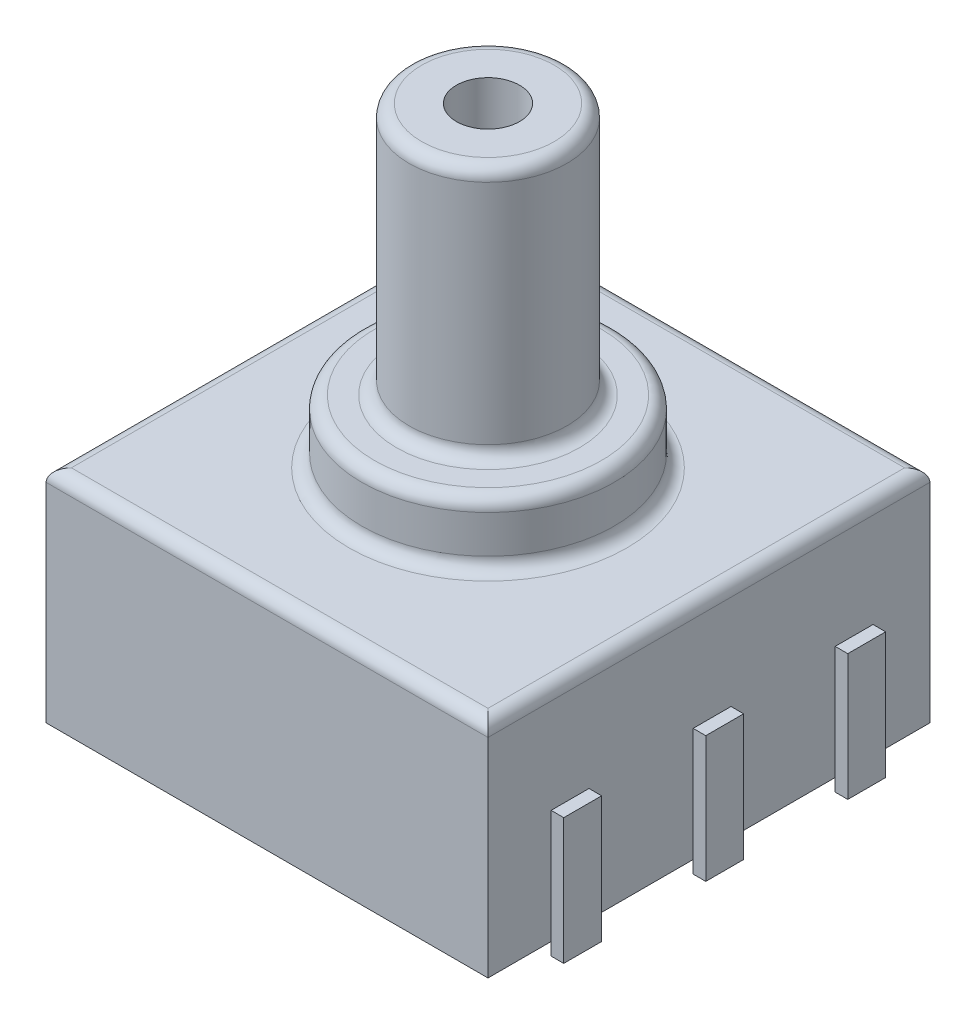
from build123d import *

# Parameters (mm, degrees)
ESQUISSE1_W                          = 7
ESQUISSE1_H                          = 7
EXTRUSION1_DEPTH                     = 3.5
CONG_1_R                             = 0.2
ESQUISSE3_W                          = 0.6
ESQUISSE3_H                          = 2
EXTRUSION2_DEPTH                     = 0.2
R_P_TITION_LIN_AIRE1_COUNT           = 3
R_P_TITION_LIN_AIRE1_PITCH           = 2.25
R_P_TITION_LIN_AIRE1_COPY_1_SKETCH_W = 0.6
R_P_TITION_LIN_AIRE1_COPY_1_SKETCH_H = 2
R_P_TITION_LIN_AIRE1_COPY_1_DEPTH    = 0.2
R_P_TITION_LIN_AIRE1_COPY_2_SKETCH_W = 0.6
R_P_TITION_LIN_AIRE1_COPY_2_SKETCH_H = 2
R_P_TITION_LIN_AIRE1_COPY_2_DEPTH    = 0.2


with BuildPart() as part:
    # Esquisse1 → Extrusion1 (new body)
    with BuildSketch(Plane(origin=(0, 0, 0), x_dir=(1, 0, 0), z_dir=(0, 1, 0))):
        Rectangle(ESQUISSE1_W, ESQUISSE1_H)
    extrude(amount=EXTRUSION1_DEPTH)

    # Esquisse2 → R_volution1 (revolve)
    with BuildSketch(Plane(origin=(0, 0, 0), x_dir=(0, 0, -1), z_dir=(1, 0, 0))):
        with BuildLine():
            Line((-2, 3.5), (-2, 4.5))
            Line((-2, 4.5), (-1.25, 4.5))
            Line((-1.25, 4.5), (-1.25, 8.3))
            ThreePointArc((-1.25, 8.3), (-1.191421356, 8.441421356), (-1.05, 8.5))
            Line((-1.05, 8.5), (-0.5, 8.5))
            Line((-0.5, 8.5), (-0.5, 3.5))
            Line((-0.5, 3.5), (-2, 3.5))
        make_face()
    revolve(axis=Axis((0, 7.028883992, 0), (0, -1, 0)))

    # Cong_1
    cong_1_edges = [part.edges().sort_by_distance(p)[0] for p in [
        (3.5, 3.5, 0),
        (0, 3.5, -3.5),
        (0, 3.5, -2),
        (0, 4.5, -2),
        (0, 4.5, -1.25),
        (-3.5, 3.5, 0),
        (0, 3.5, 3.5),
    ]]
    fillet(cong_1_edges, radius=CONG_1_R)

    # Esquisse3 → Extrusion2 (add)
    with BuildSketch(Plane(origin=(3.5, 0, 0), x_dir=(0, 0, -1), z_dir=(1, 0, 0))):
        with Locations((-2.2, 0.8)):
            Rectangle(ESQUISSE3_W, ESQUISSE3_H)
    extrusion2 = extrude(amount=EXTRUSION2_DEPTH)

    # Sym_trie1: Extrusion2 across plane
    add(extrusion2.mirror(Plane(origin=(0, 0, 0), x_dir=(0, 0, 1), z_dir=(1, 0, 0))))

    # R_p_tition lin_aire1: Extrusion2 ×3
    with Locations(*[(0, 0, -i * R_P_TITION_LIN_AIRE1_PITCH) for i in range(1, R_P_TITION_LIN_AIRE1_COUNT)]):
        add(extrusion2)

    # R_p_tition lin_aire1 copy 1 sketch → R_p_tition lin_aire1 copy 1 (add)
    with BuildSketch(Plane(origin=(-3.5, 0, -2.25), x_dir=(0, 0, -1), z_dir=(-1, 0, 0))):
        with Locations((-2.2, -0.8)):
            Rectangle(R_P_TITION_LIN_AIRE1_COPY_1_SKETCH_W, R_P_TITION_LIN_AIRE1_COPY_1_SKETCH_H)
    extrude(amount=R_P_TITION_LIN_AIRE1_COPY_1_DEPTH)

    # R_p_tition lin_aire1 copy 2 sketch → R_p_tition lin_aire1 copy 2 (add)
    with BuildSketch(Plane(origin=(-3.5, 0, -4.5), x_dir=(0, 0, -1), z_dir=(-1, 0, 0))):
        with Locations((-2.2, -0.8)):
            Rectangle(R_P_TITION_LIN_AIRE1_COPY_2_SKETCH_W, R_P_TITION_LIN_AIRE1_COPY_2_SKETCH_H)
    extrude(amount=R_P_TITION_LIN_AIRE1_COPY_2_DEPTH)


solid = part.part
